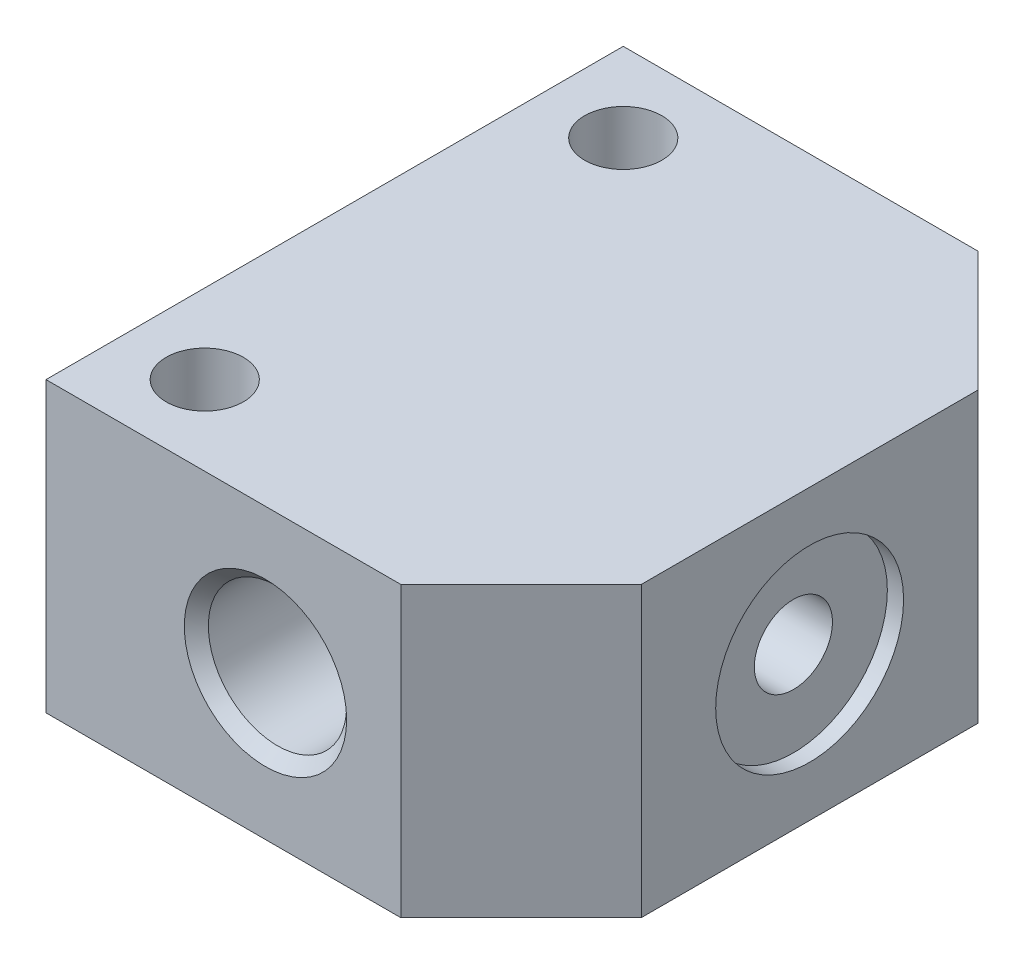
from build123d import *

# Parameters (mm, degrees)
SKETCH1_W                    = 21.59
SKETCH1_H                    = 12.192
EXTRUDE1_DEPTH               = 24.384
SKETCH4_R                    = 2.921
CUT_EXTRUDE1_DEPTH           = 8.89
SKETCH5_R                    = 1.0033
CUT_EXTRUDE2_DEPTH           = 65.707761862
FILLET1_R                    = 0.1778
FILLET1_OF_MIRROR4_R         = 0.1778
CHAMFER2_SIZE                = 0.508
SKETCH22_R                   = 1.524
CUT_EXTRUDE7_DEPTH           = 9.8298
SKETCH30_R                   = 3.96875
CUT_EXTRUDE12_DEPTH          = 0.6858
M4X0_7_TAPPED_HOLE1_D        = 3.3
M4X0_7_TAPPED_HOLE1_DEPTH    = 6.731
CHAMFER3_SIZE                = 5.08
SKETCH37_W                   = 24.384
SKETCH37_H                   = 12.192
CUT_EXTRUDE13_DEPTH          = 1.524
F_30_0_1285_DIAMETER_HOLE1_D = 3.2639


with BuildPart() as part:
    # Sketch1 → Extrude1 (new body)
    with BuildSketch(Plane.XY):
        Rectangle(SKETCH1_W, SKETCH1_H)
    extrude(amount=EXTRUDE1_DEPTH)

    # Sketch4 → Cut-Extrude1 (cut)
    with BuildSketch(Plane(origin=(-3.364314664, 0, 0), x_dir=(1, 0, 0), z_dir=(0, 0, 1))):
        with Locations((3.364314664, 0)):
            Circle(SKETCH4_R)
    cut_extrude1 = extrude(amount=CUT_EXTRUDE1_DEPTH, mode=Mode.SUBTRACT)

    # Sketch5 → Cut-Extrude2 (cut, through all)
    with BuildSketch(Plane(origin=(51.733946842, 0, 8.89), x_dir=(-1, 0, 0), z_dir=(0, 0, -1))):
        with Locations((51.733946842, 0)):
            Circle(SKETCH5_R)
    extrude(amount=-CUT_EXTRUDE2_DEPTH, mode=Mode.SUBTRACT)

    # Fillet1
    fillet1_edges = [part.edges().sort_by_distance(p)[0] for p in [
        (-2.921, 0, 8.89),
    ]]
    fillet(fillet1_edges, radius=FILLET1_R)

    # Mirror4: Cut-Extrude1 across plane
    add(cut_extrude1.mirror(Plane.XY.offset(12.192)), mode=Mode.SUBTRACT)

    # Fillet1 of Mirror4
    fillet1_of_mirror4_edges = [part.edges().sort_by_distance(p)[0] for p in [
        (-2.921, 0, 15.494),
    ]]
    fillet(fillet1_of_mirror4_edges, radius=FILLET1_OF_MIRROR4_R)

    # Chamfer2
    chamfer2_edges = [part.edges().sort_by_distance(p)[0] for p in [
        (-2.921, 0, 0),
        (-2.921, 0, 24.384),
    ]]
    chamfer(chamfer2_edges, length=CHAMFER2_SIZE)

    # Sketch22 → Cut-Extrude7 (cut)
    with BuildSketch(Plane(origin=(10.795, 0, 72.958286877), x_dir=(0, 0, 1), z_dir=(-1, 0, 0))):
        with Locations(Location((-60.766286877, 0, 0), (0, 0, 190.352217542))):
            Circle(SKETCH22_R)
    extrude(amount=CUT_EXTRUDE7_DEPTH, mode=Mode.SUBTRACT)

    # Sketch38 → Cut-Revolve2 (revolve, cut)
    with BuildSketch(Plane(origin=(0, 0, 0), x_dir=(1, 0, 0), z_dir=(0, 1, 0))):
        with BuildLine():
            Line((-0.5588, -12.192), (2.4892, -12.192))
            ThreePointArc((2.4892, -12.192), (0.9652, -10.668), (-0.5588, -12.192))
        make_face()
    revolve(axis=Axis((7.546257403, 0, 12.192), (-1, 0, 0)), mode=Mode.SUBTRACT)

    # Sketch30 → Cut-Extrude12 (cut)
    with BuildSketch(Plane(origin=(10.795, 0, 72.958286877), x_dir=(0, 0, 1), z_dir=(-1, 0, 0))):
        with Locations((-60.766286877, 0)):
            Circle(SKETCH30_R)
    extrude(amount=CUT_EXTRUDE12_DEPTH, mode=Mode.SUBTRACT)

    # M4x0.7 Tapped Hole1
    with Locations(Plane(origin=(10.795, 7.194813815, 33.951037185), x_dir=(0, 0, 1), z_dir=(1, 0, 0))):
        with Locations((-21.759037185, 7.194813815)):
            Hole(M4X0_7_TAPPED_HOLE1_D / 2, depth=M4X0_7_TAPPED_HOLE1_DEPTH)

    # Chamfer3
    chamfer3_edges = [part.edges().sort_by_distance(p)[0] for p in [
        (10.795, 0, 24.384),
        (10.795, 0, 0),
    ]]
    chamfer(chamfer3_edges, length=CHAMFER3_SIZE)

    # Sketch37 → Cut-Extrude13 (cut)
    with BuildSketch(Plane.ZY.offset(10.795)):
        with Locations((12.192, 0)):
            Rectangle(SKETCH37_W, SKETCH37_H)
    extrude(amount=-CUT_EXTRUDE13_DEPTH, mode=Mode.SUBTRACT)

    # 30 _0.1285_ Diameter Hole1 (through all)
    with Locations(Plane.XZ.offset(6.096)):
        with Locations((-5.9182, 21.0312), (-5.9182, 3.3528)):
            Hole(F_30_0_1285_DIAMETER_HOLE1_D / 2)


solid = part.part
